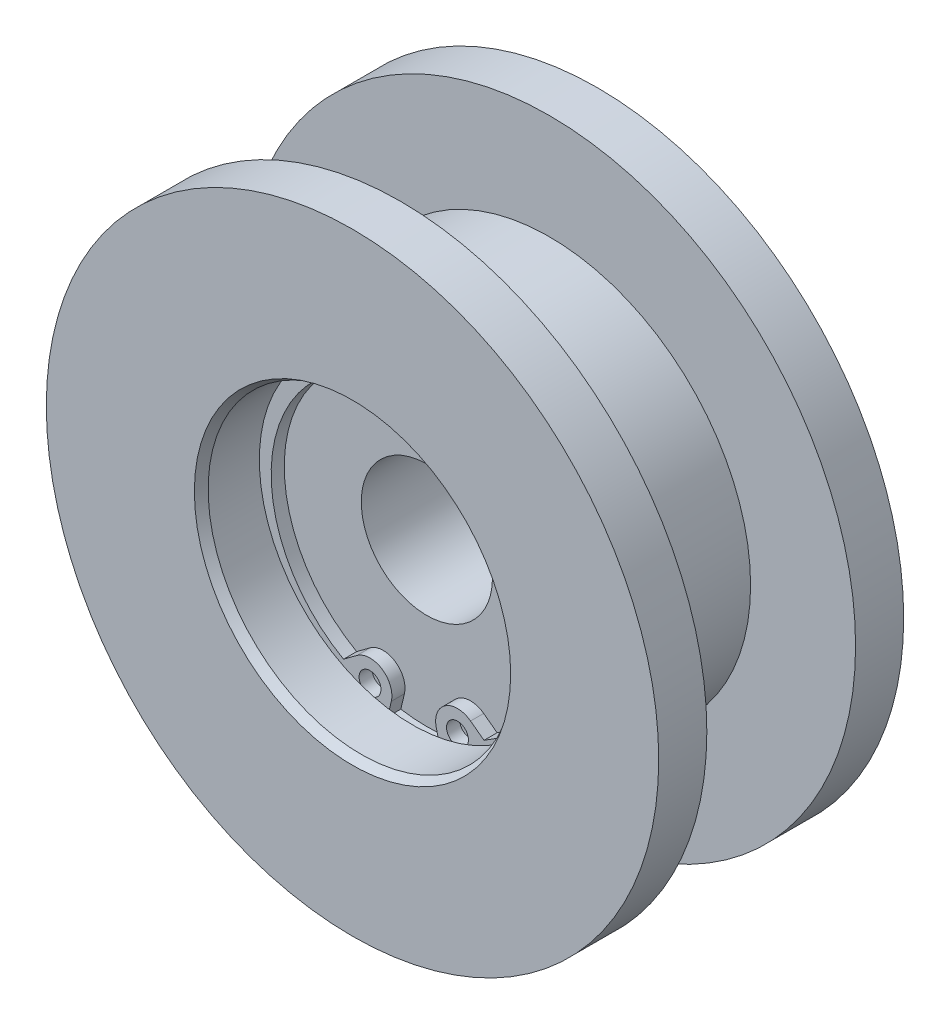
ISO-10303-21;
HEADER;
FILE_DESCRIPTION(('STEP AP214'),'2;1');
FILE_NAME('part.step','',(''),(''),'','','');
FILE_SCHEMA(('AUTOMOTIVE_DESIGN { 1 0 10303 214 1 1 1 1 }'));
ENDSEC;
DATA;
#1=APPLICATION_CONTEXT('core data for automotive mechanical design processes');
#2=APPLICATION_PROTOCOL_DEFINITION('international standard','automotive_design',2000,#1);
#3=PRODUCT_CONTEXT('',#1,'mechanical');
#4=PRODUCT('Part','Part','',(#3));
#5=PRODUCT_RELATED_PRODUCT_CATEGORY('part','',(#4));
#6=PRODUCT_DEFINITION_FORMATION('','',#4);
#7=PRODUCT_DEFINITION_CONTEXT('part definition',#1,'design');
#8=PRODUCT_DEFINITION('design','',#6,#7);
#9=PRODUCT_DEFINITION_SHAPE('','',#8);
#10=(LENGTH_UNIT() NAMED_UNIT(*) SI_UNIT(.MILLI.,.METRE.));
#11=(NAMED_UNIT(*) PLANE_ANGLE_UNIT() SI_UNIT($,.RADIAN.));
#12=(NAMED_UNIT(*) SI_UNIT($,.STERADIAN.) SOLID_ANGLE_UNIT());
#13=UNCERTAINTY_MEASURE_WITH_UNIT(LENGTH_MEASURE(1.E-05),#10,'distance_accuracy_value','');
#14=(GEOMETRIC_REPRESENTATION_CONTEXT(3) GLOBAL_UNCERTAINTY_ASSIGNED_CONTEXT((#13)) GLOBAL_UNIT_ASSIGNED_CONTEXT((#10,
#11,#12)) REPRESENTATION_CONTEXT('',''));
#15=CARTESIAN_POINT('',(0.,0.,0.));
#16=DIRECTION('',(0.,0.,1.));
#17=DIRECTION('',(1.,0.,0.));
#18=AXIS2_PLACEMENT_3D('',#15,#16,#17);
#19=CARTESIAN_POINT('',(0.,-0.9,7.1));
#20=DIRECTION('',(0.,0.,1.));
#21=DIRECTION('',(-1.,0.,0.));
#22=AXIS2_PLACEMENT_3D('',#19,#20,#21);
#23=CYLINDRICAL_SURFACE('',#22,16.3);
#24=CARTESIAN_POINT('',(0.,-0.9,7.));
#25=DIRECTION('',(0.,0.,1.));
#26=DIRECTION('',(1.,0.,0.));
#27=AXIS2_PLACEMENT_3D('',#24,#25,#26);
#28=CIRCLE('',#27,16.3);
#29=CARTESIAN_POINT('',(-8.02922574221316,-15.0852576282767,7.));
#30=VERTEX_POINT('',#29);
#31=CARTESIAN_POINT('',(8.02922574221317,-15.0852576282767,7.));
#32=VERTEX_POINT('',#31);
#33=EDGE_CURVE('E281',#30,#32,#28,.F.);
#34=ORIENTED_EDGE('',*,*,#33,.F.);
#35=DIRECTION('',(0.,0.,-1.));
#36=VECTOR('',#35,1.);
#37=CARTESIAN_POINT('',(-8.02922574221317,-15.0852576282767,7.1));
#38=LINE('',#37,#36);
#39=CARTESIAN_POINT('',(-8.02922574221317,-15.0852576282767,5.5));
#40=VERTEX_POINT('',#39);
#41=EDGE_CURVE('E246',#30,#40,#38,.T.);
#42=ORIENTED_EDGE('',*,*,#41,.T.);
#43=CARTESIAN_POINT('',(0.,-0.9,5.5));
#44=DIRECTION('',(0.,0.,-1.));
#45=DIRECTION('',(0.,-1.,0.));
#46=AXIS2_PLACEMENT_3D('',#43,#44,#45);
#47=CIRCLE('',#46,16.3);
#48=CARTESIAN_POINT('',(8.02922574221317,-15.0852576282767,5.5));
#49=VERTEX_POINT('',#48);
#50=EDGE_CURVE('E232',#40,#49,#47,.T.);
#51=ORIENTED_EDGE('',*,*,#50,.T.);
#52=DIRECTION('',(0.,0.,-1.));
#53=VECTOR('',#52,1.);
#54=CARTESIAN_POINT('',(8.02922574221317,-15.0852576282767,7.1));
#55=LINE('',#54,#53);
#56=EDGE_CURVE('E247',#32,#49,#55,.T.);
#57=ORIENTED_EDGE('',*,*,#56,.F.);
#58=EDGE_LOOP('',(#34,#42,#51,#57));
#59=FACE_BOUND('',#58,.T.);
#60=ADVANCED_FACE('F14',(#59),#23,.F.);
#61=CARTESIAN_POINT('',(6.49138441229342,-13.9421779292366,7.1));
#62=DIRECTION('',(-0.596553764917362,-0.802573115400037,0.));
#63=DIRECTION('',(-0.802573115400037,0.596553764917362,0.));
#64=AXIS2_PLACEMENT_3D('',#61,#62,#63);
#65=PLANE('',#64);
#66=DIRECTION('',(-0.802573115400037,0.596553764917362,0.));
#67=VECTOR('',#66,1.);
#68=CARTESIAN_POINT('',(6.49138441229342,-13.9421779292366,7.));
#69=LINE('',#68,#67);
#70=CARTESIAN_POINT('',(6.49138441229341,-13.9421779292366,7.));
#71=VERTEX_POINT('',#70);
#72=EDGE_CURVE('E283',#32,#71,#69,.T.);
#73=ORIENTED_EDGE('',*,*,#72,.F.);
#74=ORIENTED_EDGE('',*,*,#56,.T.);
#75=DIRECTION('',(-0.802573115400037,0.596553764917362,0.));
#76=VECTOR('',#75,1.);
#77=CARTESIAN_POINT('',(6.49138441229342,-13.9421779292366,5.5));
#78=LINE('',#77,#76);
#79=CARTESIAN_POINT('',(6.49138441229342,-13.9421779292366,5.5));
#80=VERTEX_POINT('',#79);
#81=EDGE_CURVE('E243',#49,#80,#78,.T.);
#82=ORIENTED_EDGE('',*,*,#81,.T.);
#83=DIRECTION('',(0.,0.,-1.));
#84=VECTOR('',#83,1.);
#85=CARTESIAN_POINT('',(6.49138441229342,-13.9421779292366,7.1));
#86=LINE('',#85,#84);
#87=EDGE_CURVE('E263',#71,#80,#86,.T.);
#88=ORIENTED_EDGE('',*,*,#87,.F.);
#89=EDGE_LOOP('',(#73,#74,#82,#88));
#90=FACE_BOUND('',#89,.T.);
#91=ADVANCED_FACE('F181',(#90),#65,.F.);
#92=CARTESIAN_POINT('',(5.,-15.9486107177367,7.1));
#93=DIRECTION('',(0.,0.,1.));
#94=DIRECTION('',(-1.,0.,0.));
#95=AXIS2_PLACEMENT_3D('',#92,#93,#94);
#96=CYLINDRICAL_SURFACE('',#95,2.5);
#97=DIRECTION('',(0.,0.,-1.));
#98=VECTOR('',#97,1.);
#99=CARTESIAN_POINT('',(2.5678231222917,-16.526983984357,7.1));
#100=LINE('',#99,#98);
#101=CARTESIAN_POINT('',(2.5678231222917,-16.526983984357,7.));
#102=VERTEX_POINT('',#101);
#103=CARTESIAN_POINT('',(2.5678231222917,-16.526983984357,5.5));
#104=VERTEX_POINT('',#103);
#105=EDGE_CURVE('E238',#102,#104,#100,.T.);
#106=ORIENTED_EDGE('',*,*,#105,.F.);
#107=CARTESIAN_POINT('',(5.,-15.9486107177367,7.));
#108=DIRECTION('',(0.,0.,1.));
#109=DIRECTION('',(1.,0.,0.));
#110=AXIS2_PLACEMENT_3D('',#107,#108,#109);
#111=CIRCLE('',#110,2.5);
#112=EDGE_CURVE('E285',#102,#71,#111,.F.);
#113=ORIENTED_EDGE('',*,*,#112,.T.);
#114=ORIENTED_EDGE('',*,*,#87,.T.);
#115=CARTESIAN_POINT('',(5.,-15.9486107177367,5.5));
#116=DIRECTION('',(0.,0.,1.));
#117=DIRECTION('',(1.,0.,0.));
#118=AXIS2_PLACEMENT_3D('',#115,#116,#117);
#119=CIRCLE('',#118,2.5);
#120=EDGE_CURVE('E113',#80,#104,#119,.T.);
#121=ORIENTED_EDGE('',*,*,#120,.T.);
#122=EDGE_LOOP('',(#106,#113,#114,#121));
#123=FACE_BOUND('',#122,.T.);
#124=ADVANCED_FACE('F187',(#123),#96,.T.);
#125=CARTESIAN_POINT('',(-2.56782312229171,-16.526983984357,7.1));
#126=DIRECTION('',(-0.97287075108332,0.231349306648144,0.));
#127=DIRECTION('',(0.,0.,1.));
#128=AXIS2_PLACEMENT_3D('',#125,#126,#127);
#129=PLANE('',#128);
#130=DIRECTION('',(0.231349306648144,0.97287075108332,0.));
#131=VECTOR('',#130,1.);
#132=CARTESIAN_POINT('',(-2.56782312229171,-16.526983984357,7.));
#133=LINE('',#132,#131);
#134=CARTESIAN_POINT('',(-2.97957431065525,-18.2584812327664,7.));
#135=VERTEX_POINT('',#134);
#136=CARTESIAN_POINT('',(-2.5678231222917,-16.526983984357,7.));
#137=VERTEX_POINT('',#136);
#138=EDGE_CURVE('E89',#135,#137,#133,.T.);
#139=ORIENTED_EDGE('',*,*,#138,.F.);
#140=DIRECTION('',(0.,0.,1.));
#141=VECTOR('',#140,1.);
#142=CARTESIAN_POINT('',(-2.97957431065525,-18.2584812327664,17.6183293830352));
#143=LINE('',#142,#141);
#144=CARTESIAN_POINT('',(-2.97957431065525,-18.2584812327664,5.5));
#145=VERTEX_POINT('',#144);
#146=EDGE_CURVE('E22',#145,#135,#143,.T.);
#147=ORIENTED_EDGE('',*,*,#146,.F.);
#148=DIRECTION('',(0.231349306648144,0.97287075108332,0.));
#149=VECTOR('',#148,1.);
#150=CARTESIAN_POINT('',(-2.56782312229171,-16.526983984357,5.5));
#151=LINE('',#150,#149);
#152=CARTESIAN_POINT('',(-2.56782312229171,-16.526983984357,5.5));
#153=VERTEX_POINT('',#152);
#154=EDGE_CURVE('E35',#145,#153,#151,.T.);
#155=ORIENTED_EDGE('',*,*,#154,.T.);
#156=DIRECTION('',(0.,0.,-1.));
#157=VECTOR('',#156,1.);
#158=CARTESIAN_POINT('',(-2.56782312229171,-16.526983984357,7.1));
#159=LINE('',#158,#157);
#160=EDGE_CURVE('E98',#137,#153,#159,.T.);
#161=ORIENTED_EDGE('',*,*,#160,.F.);
#162=EDGE_LOOP('',(#139,#147,#155,#161));
#163=FACE_BOUND('',#162,.T.);
#164=ADVANCED_FACE('F97',(#163),#129,.F.);
#165=CARTESIAN_POINT('',(-6.49138441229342,-13.9421779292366,7.1));
#166=DIRECTION('',(0.596553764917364,-0.802573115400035,0.));
#167=DIRECTION('',(0.,0.,-1.));
#168=AXIS2_PLACEMENT_3D('',#165,#166,#167);
#169=PLANE('',#168);
#170=DIRECTION('',(-0.802573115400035,-0.596553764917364,0.));
#171=VECTOR('',#170,1.);
#172=CARTESIAN_POINT('',(-6.49138441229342,-13.9421779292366,7.));
#173=LINE('',#172,#171);
#174=CARTESIAN_POINT('',(-6.49138441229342,-13.9421779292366,7.));
#175=VERTEX_POINT('',#174);
#176=EDGE_CURVE('E279',#175,#30,#173,.T.);
#177=ORIENTED_EDGE('',*,*,#176,.F.);
#178=DIRECTION('',(0.,0.,-1.));
#179=VECTOR('',#178,1.);
#180=CARTESIAN_POINT('',(-6.49138441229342,-13.9421779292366,7.1));
#181=LINE('',#180,#179);
#182=CARTESIAN_POINT('',(-6.49138441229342,-13.9421779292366,5.5));
#183=VERTEX_POINT('',#182);
#184=EDGE_CURVE('E109',#175,#183,#181,.T.);
#185=ORIENTED_EDGE('',*,*,#184,.T.);
#186=DIRECTION('',(-0.802573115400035,-0.596553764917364,0.));
#187=VECTOR('',#186,1.);
#188=CARTESIAN_POINT('',(-6.49138441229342,-13.9421779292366,5.5));
#189=LINE('',#188,#187);
#190=EDGE_CURVE('E105',#183,#40,#189,.T.);
#191=ORIENTED_EDGE('',*,*,#190,.T.);
#192=ORIENTED_EDGE('',*,*,#41,.F.);
#193=EDGE_LOOP('',(#177,#185,#191,#192));
#194=FACE_BOUND('',#193,.T.);
#195=ADVANCED_FACE('F197',(#194),#169,.F.);
#196=CARTESIAN_POINT('',(-5.,-15.9486107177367,7.1));
#197=DIRECTION('',(0.,0.,1.));
#198=DIRECTION('',(-1.,0.,0.));
#199=AXIS2_PLACEMENT_3D('',#196,#197,#198);
#200=CYLINDRICAL_SURFACE('',#199,2.5);
#201=ORIENTED_EDGE('',*,*,#184,.F.);
#202=CARTESIAN_POINT('',(-5.,-15.9486107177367,7.));
#203=DIRECTION('',(0.,0.,1.));
#204=DIRECTION('',(1.,0.,0.));
#205=AXIS2_PLACEMENT_3D('',#202,#203,#204);
#206=CIRCLE('',#205,2.5);
#207=EDGE_CURVE('E100',#175,#137,#206,.F.);
#208=ORIENTED_EDGE('',*,*,#207,.T.);
#209=ORIENTED_EDGE('',*,*,#160,.T.);
#210=CARTESIAN_POINT('',(-5.,-15.9486107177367,5.5));
#211=DIRECTION('',(0.,0.,1.));
#212=DIRECTION('',(-1.,0.,0.));
#213=AXIS2_PLACEMENT_3D('',#210,#211,#212);
#214=CIRCLE('',#213,2.5);
#215=EDGE_CURVE('E220',#153,#183,#214,.T.);
#216=ORIENTED_EDGE('',*,*,#215,.T.);
#217=EDGE_LOOP('',(#201,#208,#209,#216));
#218=FACE_BOUND('',#217,.T.);
#219=ADVANCED_FACE('F204',(#218),#200,.T.);
#220=CARTESIAN_POINT('',(2.5678231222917,-16.526983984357,7.1));
#221=DIRECTION('',(0.972870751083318,0.231349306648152,0.));
#222=DIRECTION('',(0.,0.,-1.));
#223=AXIS2_PLACEMENT_3D('',#220,#221,#222);
#224=PLANE('',#223);
#225=DIRECTION('',(0.231349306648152,-0.972870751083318,0.));
#226=VECTOR('',#225,1.);
#227=CARTESIAN_POINT('',(2.5678231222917,-16.526983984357,7.));
#228=LINE('',#227,#226);
#229=CARTESIAN_POINT('',(2.97957431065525,-18.2584812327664,7.));
#230=VERTEX_POINT('',#229);
#231=EDGE_CURVE('E92',#102,#230,#228,.T.);
#232=ORIENTED_EDGE('',*,*,#231,.F.);
#233=ORIENTED_EDGE('',*,*,#105,.T.);
#234=DIRECTION('',(0.231349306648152,-0.972870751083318,0.));
#235=VECTOR('',#234,1.);
#236=CARTESIAN_POINT('',(2.5678231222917,-16.526983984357,5.5));
#237=LINE('',#236,#235);
#238=CARTESIAN_POINT('',(2.97957431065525,-18.2584812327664,5.5));
#239=VERTEX_POINT('',#238);
#240=EDGE_CURVE('E236',#104,#239,#237,.T.);
#241=ORIENTED_EDGE('',*,*,#240,.T.);
#242=DIRECTION('',(0.,0.,1.));
#243=VECTOR('',#242,1.);
#244=CARTESIAN_POINT('',(2.97957431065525,-18.2584812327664,17.6183293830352));
#245=LINE('',#244,#243);
#246=EDGE_CURVE('E9',#230,#239,#245,.F.);
#247=ORIENTED_EDGE('',*,*,#246,.F.);
#248=EDGE_LOOP('',(#232,#233,#241,#247));
#249=FACE_BOUND('',#248,.T.);
#250=ADVANCED_FACE('F193',(#249),#224,.F.);
#251=CARTESIAN_POINT('',(0.,0.,17.6183293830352));
#252=DIRECTION('',(0.,0.,1.));
#253=DIRECTION('',(1.,0.,0.));
#254=AXIS2_PLACEMENT_3D('',#251,#252,#253);
#255=CYLINDRICAL_SURFACE('',#254,23.);
#256=CARTESIAN_POINT('',(0.,0.,8.5));
#257=DIRECTION('',(0.,0.,1.));
#258=DIRECTION('',(1.,0.,0.));
#259=AXIS2_PLACEMENT_3D('',#256,#257,#258);
#260=CIRCLE('',#259,23.);
#261=CARTESIAN_POINT('',(23.,0.,8.5));
#262=VERTEX_POINT('',#261);
#263=EDGE_CURVE('E126',#262,#262,#260,.T.);
#264=ORIENTED_EDGE('',*,*,#263,.F.);
#265=EDGE_LOOP('',(#264));
#266=FACE_BOUND('',#265,.T.);
#267=CARTESIAN_POINT('',(0.,0.,-8.5));
#268=DIRECTION('',(0.,0.,1.));
#269=DIRECTION('',(1.,0.,0.));
#270=AXIS2_PLACEMENT_3D('',#267,#268,#269);
#271=CIRCLE('',#270,23.);
#272=CARTESIAN_POINT('',(23.,0.,-8.5));
#273=VERTEX_POINT('',#272);
#274=EDGE_CURVE('E123',#273,#273,#271,.T.);
#275=ORIENTED_EDGE('',*,*,#274,.T.);
#276=EDGE_LOOP('',(#275));
#277=FACE_BOUND('',#276,.T.);
#278=ADVANCED_FACE('F216',(#266,#277),#255,.T.);
#279=CARTESIAN_POINT('',(0.,23.,8.5));
#280=DIRECTION('',(0.,0.,1.));
#281=DIRECTION('',(1.,0.,0.));
#282=AXIS2_PLACEMENT_3D('',#279,#280,#281);
#283=PLANE('',#282);
#284=CARTESIAN_POINT('',(0.,0.,8.5));
#285=DIRECTION('',(0.,0.,1.));
#286=DIRECTION('',(1.,0.,0.));
#287=AXIS2_PLACEMENT_3D('',#284,#285,#286);
#288=CIRCLE('',#287,35.);
#289=CARTESIAN_POINT('',(35.,0.,8.5));
#290=VERTEX_POINT('',#289);
#291=EDGE_CURVE('E129',#290,#290,#288,.T.);
#292=ORIENTED_EDGE('',*,*,#291,.F.);
#293=EDGE_LOOP('',(#292));
#294=FACE_BOUND('',#293,.T.);
#295=ORIENTED_EDGE('',*,*,#263,.T.);
#296=EDGE_LOOP('',(#295));
#297=FACE_BOUND('',#296,.T.);
#298=ADVANCED_FACE('F469',(#294,#297),#283,.F.);
#299=CARTESIAN_POINT('',(0.,35.,-8.5));
#300=DIRECTION('',(0.,0.,-1.));
#301=DIRECTION('',(-1.,0.,0.));
#302=AXIS2_PLACEMENT_3D('',#299,#300,#301);
#303=PLANE('',#302);
#304=ORIENTED_EDGE('',*,*,#274,.F.);
#305=EDGE_LOOP('',(#304));
#306=FACE_BOUND('',#305,.T.);
#307=CARTESIAN_POINT('',(0.,0.,-8.5));
#308=DIRECTION('',(0.,0.,1.));
#309=DIRECTION('',(1.,0.,0.));
#310=AXIS2_PLACEMENT_3D('',#307,#308,#309);
#311=CIRCLE('',#310,35.);
#312=CARTESIAN_POINT('',(35.,0.,-8.5));
#313=VERTEX_POINT('',#312);
#314=EDGE_CURVE('E120',#313,#313,#311,.T.);
#315=ORIENTED_EDGE('',*,*,#314,.T.);
#316=EDGE_LOOP('',(#315));
#317=FACE_BOUND('',#316,.T.);
#318=ADVANCED_FACE('F460',(#306,#317),#303,.F.);
#319=CARTESIAN_POINT('',(0.,0.,17.6183293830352));
#320=DIRECTION('',(0.,0.,1.));
#321=DIRECTION('',(1.,0.,0.));
#322=AXIS2_PLACEMENT_3D('',#319,#320,#321);
#323=CYLINDRICAL_SURFACE('',#322,35.);
#324=CARTESIAN_POINT('',(0.,0.,14.));
#325=DIRECTION('',(0.,0.,1.));
#326=DIRECTION('',(1.,0.,0.));
#327=AXIS2_PLACEMENT_3D('',#324,#325,#326);
#328=CIRCLE('',#327,35.);
#329=CARTESIAN_POINT('',(35.,0.,14.));
#330=VERTEX_POINT('',#329);
#331=EDGE_CURVE('E132',#330,#330,#328,.T.);
#332=ORIENTED_EDGE('',*,*,#331,.F.);
#333=EDGE_LOOP('',(#332));
#334=FACE_BOUND('',#333,.T.);
#335=ORIENTED_EDGE('',*,*,#291,.T.);
#336=EDGE_LOOP('',(#335));
#337=FACE_BOUND('',#336,.T.);
#338=ADVANCED_FACE('F452',(#334,#337),#323,.T.);
#339=CARTESIAN_POINT('',(0.,0.,17.6183293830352));
#340=DIRECTION('',(0.,0.,1.));
#341=DIRECTION('',(1.,0.,0.));
#342=AXIS2_PLACEMENT_3D('',#339,#340,#341);
#343=CYLINDRICAL_SURFACE('',#342,35.);
#344=ORIENTED_EDGE('',*,*,#314,.F.);
#345=EDGE_LOOP('',(#344));
#346=FACE_BOUND('',#345,.T.);
#347=CARTESIAN_POINT('',(0.,0.,-14.));
#348=DIRECTION('',(0.,0.,1.));
#349=DIRECTION('',(1.,0.,0.));
#350=AXIS2_PLACEMENT_3D('',#347,#348,#349);
#351=CIRCLE('',#350,35.);
#352=CARTESIAN_POINT('',(35.,0.,-14.));
#353=VERTEX_POINT('',#352);
#354=EDGE_CURVE('E154',#353,#353,#351,.T.);
#355=ORIENTED_EDGE('',*,*,#354,.T.);
#356=EDGE_LOOP('',(#355));
#357=FACE_BOUND('',#356,.T.);
#358=ADVANCED_FACE('F16',(#346,#357),#343,.T.);
#359=CARTESIAN_POINT('',(0.,35.,14.));
#360=DIRECTION('',(0.,0.,-1.));
#361=DIRECTION('',(-1.,0.,0.));
#362=AXIS2_PLACEMENT_3D('',#359,#360,#361);
#363=PLANE('',#362);
#364=CARTESIAN_POINT('',(0.,0.,14.));
#365=DIRECTION('',(0.,0.,1.));
#366=DIRECTION('',(1.,0.,0.));
#367=AXIS2_PLACEMENT_3D('',#364,#365,#366);
#368=CIRCLE('',#367,18.0773502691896);
#369=CARTESIAN_POINT('',(18.0773502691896,0.,14.));
#370=VERTEX_POINT('',#369);
#371=EDGE_CURVE('E135',#370,#370,#368,.T.);
#372=ORIENTED_EDGE('',*,*,#371,.F.);
#373=EDGE_LOOP('',(#372));
#374=FACE_BOUND('',#373,.T.);
#375=ORIENTED_EDGE('',*,*,#331,.T.);
#376=EDGE_LOOP('',(#375));
#377=FACE_BOUND('',#376,.T.);
#378=ADVANCED_FACE('F436',(#374,#377),#363,.F.);
#379=CARTESIAN_POINT('',(0.,14.5,-14.));
#380=DIRECTION('',(0.,0.,1.));
#381=DIRECTION('',(1.,0.,0.));
#382=AXIS2_PLACEMENT_3D('',#379,#380,#381);
#383=PLANE('',#382);
#384=ORIENTED_EDGE('',*,*,#354,.F.);
#385=EDGE_LOOP('',(#384));
#386=FACE_BOUND('',#385,.T.);
#387=CARTESIAN_POINT('',(0.,0.,-14.));
#388=DIRECTION('',(0.,0.,1.));
#389=DIRECTION('',(1.,0.,0.));
#390=AXIS2_PLACEMENT_3D('',#387,#388,#389);
#391=CIRCLE('',#390,14.5);
#392=CARTESIAN_POINT('',(14.5,0.,-14.));
#393=VERTEX_POINT('',#392);
#394=EDGE_CURVE('E151',#393,#393,#391,.T.);
#395=ORIENTED_EDGE('',*,*,#394,.T.);
#396=EDGE_LOOP('',(#395));
#397=FACE_BOUND('',#396,.T.);
#398=ADVANCED_FACE('F427',(#386,#397),#383,.F.);
#399=CARTESIAN_POINT('',(0.,0.,14.));
#400=DIRECTION('',(0.,0.,1.));
#401=DIRECTION('',(1.,0.,0.));
#402=AXIS2_PLACEMENT_3D('',#399,#400,#401);
#403=CONICAL_SURFACE('',#402,18.0773502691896,0.5235987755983);
#404=CARTESIAN_POINT('',(0.,0.,13.));
#405=DIRECTION('',(0.,0.,1.));
#406=DIRECTION('',(1.,0.,0.));
#407=AXIS2_PLACEMENT_3D('',#404,#405,#406);
#408=CIRCLE('',#407,17.5);
#409=CARTESIAN_POINT('',(17.5,0.,13.));
#410=VERTEX_POINT('',#409);
#411=EDGE_CURVE('E138',#410,#410,#408,.T.);
#412=ORIENTED_EDGE('',*,*,#411,.F.);
#413=EDGE_LOOP('',(#412));
#414=FACE_BOUND('',#413,.T.);
#415=ORIENTED_EDGE('',*,*,#371,.T.);
#416=EDGE_LOOP('',(#415));
#417=FACE_BOUND('',#416,.T.);
#418=ADVANCED_FACE('F418',(#414,#417),#403,.F.);
#419=CARTESIAN_POINT('',(0.,0.,17.6183293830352));
#420=DIRECTION('',(0.,0.,1.));
#421=DIRECTION('',(1.,0.,0.));
#422=AXIS2_PLACEMENT_3D('',#419,#420,#421);
#423=CYLINDRICAL_SURFACE('',#422,14.5);
#424=ORIENTED_EDGE('',*,*,#394,.F.);
#425=EDGE_LOOP('',(#424));
#426=FACE_BOUND('',#425,.T.);
#427=CARTESIAN_POINT('',(0.,0.,-5.5));
#428=DIRECTION('',(0.,0.,1.));
#429=DIRECTION('',(1.,0.,0.));
#430=AXIS2_PLACEMENT_3D('',#427,#428,#429);
#431=CIRCLE('',#430,14.5);
#432=CARTESIAN_POINT('',(14.5,0.,-5.5));
#433=VERTEX_POINT('',#432);
#434=EDGE_CURVE('E148',#433,#433,#431,.T.);
#435=ORIENTED_EDGE('',*,*,#434,.T.);
#436=EDGE_LOOP('',(#435));
#437=FACE_BOUND('',#436,.T.);
#438=ADVANCED_FACE('F409',(#426,#437),#423,.F.);
#439=CARTESIAN_POINT('',(0.,0.,17.6183293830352));
#440=DIRECTION('',(0.,0.,1.));
#441=DIRECTION('',(1.,0.,0.));
#442=AXIS2_PLACEMENT_3D('',#439,#440,#441);
#443=CYLINDRICAL_SURFACE('',#442,17.5);
#444=CARTESIAN_POINT('',(0.,0.,7.15));
#445=DIRECTION('',(0.,0.,1.));
#446=DIRECTION('',(1.,0.,0.));
#447=AXIS2_PLACEMENT_3D('',#444,#445,#446);
#448=CIRCLE('',#447,17.5);
#449=CARTESIAN_POINT('',(17.5,0.,7.15));
#450=VERTEX_POINT('',#449);
#451=EDGE_CURVE('E118',#450,#450,#448,.F.);
#452=ORIENTED_EDGE('',*,*,#451,.T.);
#453=EDGE_LOOP('',(#452));
#454=FACE_BOUND('',#453,.T.);
#455=ORIENTED_EDGE('',*,*,#411,.T.);
#456=EDGE_LOOP('',(#455));
#457=FACE_BOUND('',#456,.T.);
#458=ADVANCED_FACE('F160',(#454,#457),#443,.F.);
#459=CARTESIAN_POINT('',(0.,14.5,-5.5));
#460=DIRECTION('',(0.,0.,1.));
#461=DIRECTION('',(1.,0.,0.));
#462=AXIS2_PLACEMENT_3D('',#459,#460,#461);
#463=PLANE('',#462);
#464=ORIENTED_EDGE('',*,*,#434,.F.);
#465=EDGE_LOOP('',(#464));
#466=FACE_BOUND('',#465,.T.);
#467=CARTESIAN_POINT('',(0.,0.,-5.5));
#468=DIRECTION('',(0.,0.,1.));
#469=DIRECTION('',(1.,0.,0.));
#470=AXIS2_PLACEMENT_3D('',#467,#468,#469);
#471=CIRCLE('',#470,7.5);
#472=CARTESIAN_POINT('',(7.5,0.,-5.5));
#473=VERTEX_POINT('',#472);
#474=EDGE_CURVE('E145',#473,#473,#471,.T.);
#475=ORIENTED_EDGE('',*,*,#474,.T.);
#476=EDGE_LOOP('',(#475));
#477=FACE_BOUND('',#476,.T.);
#478=ADVANCED_FACE('F165',(#466,#477),#463,.F.);
#479=CARTESIAN_POINT('',(0.,0.,7.15));
#480=DIRECTION('',(0.,0.,1.));
#481=DIRECTION('',(1.,0.,0.));
#482=AXIS2_PLACEMENT_3D('',#479,#480,#481);
#483=PLANE('',#482);
#484=CARTESIAN_POINT('',(0.,0.,7.15));
#485=DIRECTION('',(0.,0.,1.));
#486=DIRECTION('',(1.,0.,0.));
#487=AXIS2_PLACEMENT_3D('',#484,#485,#486);
#488=CIRCLE('',#487,18.5);
#489=CARTESIAN_POINT('',(18.5,0.,7.15));
#490=VERTEX_POINT('',#489);
#491=EDGE_CURVE('E115',#490,#490,#488,.T.);
#492=ORIENTED_EDGE('',*,*,#491,.F.);
#493=EDGE_LOOP('',(#492));
#494=FACE_BOUND('',#493,.T.);
#495=ORIENTED_EDGE('',*,*,#451,.F.);
#496=EDGE_LOOP('',(#495));
#497=FACE_BOUND('',#496,.T.);
#498=ADVANCED_FACE('F163',(#494,#497),#483,.F.);
#499=CARTESIAN_POINT('',(0.,0.,17.6183293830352));
#500=DIRECTION('',(0.,0.,1.));
#501=DIRECTION('',(1.,0.,0.));
#502=AXIS2_PLACEMENT_3D('',#499,#500,#501);
#503=CYLINDRICAL_SURFACE('',#502,18.5);
#504=CARTESIAN_POINT('',(0.,0.,7.));
#505=DIRECTION('',(0.,0.,1.));
#506=DIRECTION('',(1.,0.,0.));
#507=AXIS2_PLACEMENT_3D('',#504,#505,#506);
#508=CIRCLE('',#507,18.5);
#509=EDGE_CURVE('E85',#230,#135,#508,.T.);
#510=ORIENTED_EDGE('',*,*,#509,.F.);
#511=ORIENTED_EDGE('',*,*,#246,.T.);
#512=CARTESIAN_POINT('',(0.,0.,5.5));
#513=DIRECTION('',(0.,0.,1.));
#514=DIRECTION('',(1.,0.,0.));
#515=AXIS2_PLACEMENT_3D('',#512,#513,#514);
#516=CIRCLE('',#515,18.5);
#517=EDGE_CURVE('E104',#145,#239,#516,.T.);
#518=ORIENTED_EDGE('',*,*,#517,.F.);
#519=ORIENTED_EDGE('',*,*,#146,.T.);
#520=EDGE_LOOP('',(#510,#511,#518,#519));
#521=FACE_BOUND('',#520,.T.);
#522=ORIENTED_EDGE('',*,*,#491,.T.);
#523=EDGE_LOOP('',(#522));
#524=FACE_BOUND('',#523,.T.);
#525=ADVANCED_FACE('F102',(#521,#524),#503,.F.);
#526=CARTESIAN_POINT('',(0.,0.,17.6183293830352));
#527=DIRECTION('',(0.,0.,1.));
#528=DIRECTION('',(1.,0.,0.));
#529=AXIS2_PLACEMENT_3D('',#526,#527,#528);
#530=CYLINDRICAL_SURFACE('',#529,7.5);
#531=ORIENTED_EDGE('',*,*,#474,.F.);
#532=EDGE_LOOP('',(#531));
#533=FACE_BOUND('',#532,.T.);
#534=CARTESIAN_POINT('',(0.,0.,5.5));
#535=DIRECTION('',(0.,0.,1.));
#536=DIRECTION('',(1.,0.,0.));
#537=AXIS2_PLACEMENT_3D('',#534,#535,#536);
#538=CIRCLE('',#537,7.5);
#539=CARTESIAN_POINT('',(7.5,0.,5.5));
#540=VERTEX_POINT('',#539);
#541=EDGE_CURVE('E142',#540,#540,#538,.T.);
#542=ORIENTED_EDGE('',*,*,#541,.T.);
#543=EDGE_LOOP('',(#542));
#544=FACE_BOUND('',#543,.T.);
#545=ADVANCED_FACE('F173',(#533,#544),#530,.F.);
#546=CARTESIAN_POINT('',(0.,7.5,5.5));
#547=DIRECTION('',(0.,0.,-1.));
#548=DIRECTION('',(-1.,0.,0.));
#549=AXIS2_PLACEMENT_3D('',#546,#547,#548);
#550=PLANE('',#549);
#551=ORIENTED_EDGE('',*,*,#541,.F.);
#552=EDGE_LOOP('',(#551));
#553=FACE_BOUND('',#552,.T.);
#554=ORIENTED_EDGE('',*,*,#517,.T.);
#555=ORIENTED_EDGE('',*,*,#240,.F.);
#556=ORIENTED_EDGE('',*,*,#120,.F.);
#557=ORIENTED_EDGE('',*,*,#81,.F.);
#558=ORIENTED_EDGE('',*,*,#50,.F.);
#559=ORIENTED_EDGE('',*,*,#190,.F.);
#560=ORIENTED_EDGE('',*,*,#215,.F.);
#561=ORIENTED_EDGE('',*,*,#154,.F.);
#562=EDGE_LOOP('',(#554,#555,#556,#557,#558,#559,#560,#561));
#563=FACE_BOUND('',#562,.T.);
#564=ADVANCED_FACE('F292',(#553,#563),#550,.F.);
#565=CARTESIAN_POINT('',(0.,0.,7.));
#566=DIRECTION('',(0.,0.,1.));
#567=DIRECTION('',(1.,0.,0.));
#568=AXIS2_PLACEMENT_3D('',#565,#566,#567);
#569=PLANE('',#568);
#570=ORIENTED_EDGE('',*,*,#138,.T.);
#571=ORIENTED_EDGE('',*,*,#207,.F.);
#572=ORIENTED_EDGE('',*,*,#176,.T.);
#573=ORIENTED_EDGE('',*,*,#33,.T.);
#574=ORIENTED_EDGE('',*,*,#72,.T.);
#575=ORIENTED_EDGE('',*,*,#112,.F.);
#576=ORIENTED_EDGE('',*,*,#231,.T.);
#577=ORIENTED_EDGE('',*,*,#509,.T.);
#578=EDGE_LOOP('',(#570,#571,#572,#573,#574,#575,#576,#577));
#579=FACE_BOUND('',#578,.T.);
#580=CARTESIAN_POINT('',(-5.,-15.9486107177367,7.));
#581=DIRECTION('',(0.,0.,1.));
#582=DIRECTION('',(1.,0.,0.));
#583=AXIS2_PLACEMENT_3D('',#580,#581,#582);
#584=CIRCLE('',#583,1.25);
#585=CARTESIAN_POINT('',(-3.75,-15.9486107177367,7.));
#586=VERTEX_POINT('',#585);
#587=EDGE_CURVE('E99',#586,#586,#584,.F.);
#588=ORIENTED_EDGE('',*,*,#587,.T.);
#589=EDGE_LOOP('',(#588));
#590=FACE_BOUND('',#589,.T.);
#591=CARTESIAN_POINT('',(5.,-15.9486107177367,7.));
#592=DIRECTION('',(0.,0.,1.));
#593=DIRECTION('',(1.,0.,0.));
#594=AXIS2_PLACEMENT_3D('',#591,#592,#593);
#595=CIRCLE('',#594,1.25);
#596=CARTESIAN_POINT('',(6.25,-15.9486107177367,7.));
#597=VERTEX_POINT('',#596);
#598=EDGE_CURVE('E119',#597,#597,#595,.F.);
#599=ORIENTED_EDGE('',*,*,#598,.T.);
#600=EDGE_LOOP('',(#599));
#601=FACE_BOUND('',#600,.T.);
#602=ADVANCED_FACE('F87',(#579,#590,#601),#569,.T.);
#603=CARTESIAN_POINT('',(-5.,-15.9486107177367,5.5));
#604=DIRECTION('',(0.,0.,-1.));
#605=DIRECTION('',(1.,0.,0.));
#606=AXIS2_PLACEMENT_3D('',#603,#604,#605);
#607=CIRCLE('',#606,1.25);
#608=CARTESIAN_POINT('',(-3.75,-15.9486107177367,5.5));
#609=VERTEX_POINT('',#608);
#610=EDGE_CURVE('E156',#609,#609,#607,.T.);
#611=ORIENTED_EDGE('',*,*,#610,.F.);
#612=EDGE_LOOP('',(#611));
#613=FACE_BOUND('',#612,.T.);
#614=ADVANCED_FACE('F209',(#613),#550,.F.);
#615=CARTESIAN_POINT('',(-5.,-15.9486107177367,7.1));
#616=DIRECTION('',(0.,0.,1.));
#617=DIRECTION('',(-1.,0.,0.));
#618=AXIS2_PLACEMENT_3D('',#615,#616,#617);
#619=CYLINDRICAL_SURFACE('',#618,1.25);
#620=ORIENTED_EDGE('',*,*,#610,.T.);
#621=EDGE_LOOP('',(#620));
#622=FACE_BOUND('',#621,.T.);
#623=ORIENTED_EDGE('',*,*,#587,.F.);
#624=EDGE_LOOP('',(#623));
#625=FACE_BOUND('',#624,.T.);
#626=ADVANCED_FACE('F207',(#622,#625),#619,.F.);
#627=CARTESIAN_POINT('',(5.,-15.9486107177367,5.5));
#628=DIRECTION('',(0.,0.,1.));
#629=DIRECTION('',(1.,0.,0.));
#630=AXIS2_PLACEMENT_3D('',#627,#628,#629);
#631=CIRCLE('',#630,1.25);
#632=CARTESIAN_POINT('',(6.25,-15.9486107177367,5.5));
#633=VERTEX_POINT('',#632);
#634=EDGE_CURVE('E224',#633,#633,#631,.T.);
#635=ORIENTED_EDGE('',*,*,#634,.T.);
#636=EDGE_LOOP('',(#635));
#637=FACE_BOUND('',#636,.T.);
#638=ADVANCED_FACE('F201',(#637),#550,.F.);
#639=CARTESIAN_POINT('',(5.,-15.9486107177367,7.1));
#640=DIRECTION('',(0.,0.,1.));
#641=DIRECTION('',(-1.,0.,0.));
#642=AXIS2_PLACEMENT_3D('',#639,#640,#641);
#643=CYLINDRICAL_SURFACE('',#642,1.25);
#644=ORIENTED_EDGE('',*,*,#634,.F.);
#645=EDGE_LOOP('',(#644));
#646=FACE_BOUND('',#645,.T.);
#647=ORIENTED_EDGE('',*,*,#598,.F.);
#648=EDGE_LOOP('',(#647));
#649=FACE_BOUND('',#648,.T.);
#650=ADVANCED_FACE('F198',(#646,#649),#643,.F.);
#651=CLOSED_SHELL('',(#60,#91,#124,#164,#195,#219,#250,#278,#298,#318,#338,#358,#378,#398,#418,
#438,#458,#478,#498,#525,#545,#564,#602,#614,#626,#638,#650));
#652=MANIFOLD_SOLID_BREP('B1',#651);
#653=ADVANCED_BREP_SHAPE_REPRESENTATION('',(#18,#652),#14);
#654=SHAPE_DEFINITION_REPRESENTATION(#9,#653);
ENDSEC;
END-ISO-10303-21;
